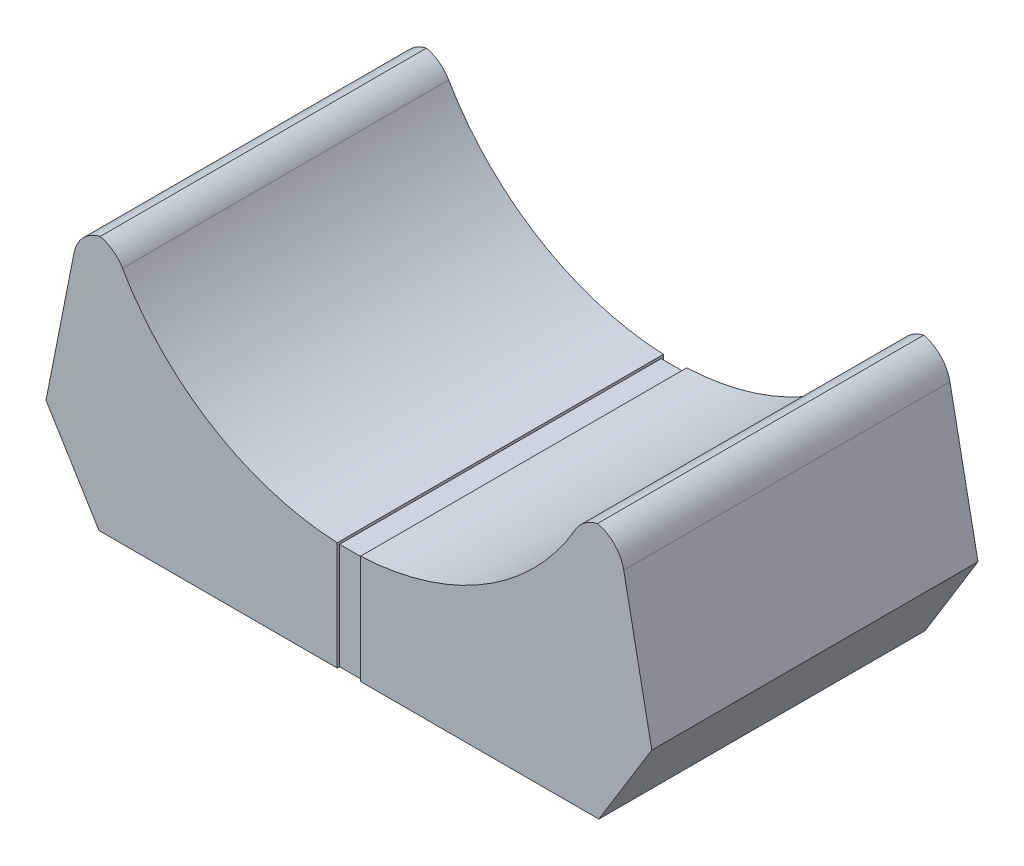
ISO-10303-21;
HEADER;
FILE_DESCRIPTION(('STEP AP214'),'2;1');
FILE_NAME('part.step','',(''),(''),'','','');
FILE_SCHEMA(('AUTOMOTIVE_DESIGN { 1 0 10303 214 1 1 1 1 }'));
ENDSEC;
DATA;
#1=APPLICATION_CONTEXT('core data for automotive mechanical design processes');
#2=APPLICATION_PROTOCOL_DEFINITION('international standard','automotive_design',2000,#1);
#3=PRODUCT_CONTEXT('',#1,'mechanical');
#4=PRODUCT('Part','Part','',(#3));
#5=PRODUCT_RELATED_PRODUCT_CATEGORY('part','',(#4));
#6=PRODUCT_DEFINITION_FORMATION('','',#4);
#7=PRODUCT_DEFINITION_CONTEXT('part definition',#1,'design');
#8=PRODUCT_DEFINITION('design','',#6,#7);
#9=PRODUCT_DEFINITION_SHAPE('','',#8);
#10=(LENGTH_UNIT() NAMED_UNIT(*) SI_UNIT(.MILLI.,.METRE.));
#11=(NAMED_UNIT(*) PLANE_ANGLE_UNIT() SI_UNIT($,.RADIAN.));
#12=(NAMED_UNIT(*) SI_UNIT($,.STERADIAN.) SOLID_ANGLE_UNIT());
#13=UNCERTAINTY_MEASURE_WITH_UNIT(LENGTH_MEASURE(1.E-05),#10,'distance_accuracy_value','');
#14=(GEOMETRIC_REPRESENTATION_CONTEXT(3) GLOBAL_UNCERTAINTY_ASSIGNED_CONTEXT((#13)) GLOBAL_UNIT_ASSIGNED_CONTEXT((#10,
#11,#12)) REPRESENTATION_CONTEXT('',''));
#15=CARTESIAN_POINT('',(0.,0.,0.));
#16=DIRECTION('',(0.,0.,1.));
#17=DIRECTION('',(1.,0.,0.));
#18=AXIS2_PLACEMENT_3D('',#15,#16,#17);
#19=CARTESIAN_POINT('',(0.,15.8773975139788,-8.));
#20=DIRECTION('',(0.,0.,1.));
#21=DIRECTION('',(1.,0.,0.));
#22=AXIS2_PLACEMENT_3D('',#19,#20,#21);
#23=CYLINDRICAL_SURFACE('',#22,11.2283279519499);
#24=CARTESIAN_POINT('',(0.,15.8773975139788,-8.));
#25=DIRECTION('',(0.,0.,1.));
#26=DIRECTION('',(1.,0.,0.));
#27=AXIS2_PLACEMENT_3D('',#24,#25,#26);
#28=CIRCLE('',#27,11.2283279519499);
#29=CARTESIAN_POINT('',(0.499999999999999,4.66020764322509,-8.));
#30=VERTEX_POINT('',#29);
#31=CARTESIAN_POINT('',(9.71726791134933,10.251559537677,-8.));
#32=VERTEX_POINT('',#31);
#33=EDGE_CURVE('E271',#30,#32,#28,.T.);
#34=ORIENTED_EDGE('',*,*,#33,.F.);
#35=DIRECTION('',(0.,0.,1.));
#36=VECTOR('',#35,1.);
#37=CARTESIAN_POINT('',(0.5,4.66020764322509,-8.));
#38=LINE('',#37,#36);
#39=CARTESIAN_POINT('',(0.5,4.66020764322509,6.));
#40=VERTEX_POINT('',#39);
#41=EDGE_CURVE('E44',#30,#40,#38,.T.);
#42=ORIENTED_EDGE('',*,*,#41,.T.);
#43=CARTESIAN_POINT('',(0.,15.8773975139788,6.));
#44=DIRECTION('',(0.,0.,-1.));
#45=DIRECTION('',(-1.,0.,0.));
#46=AXIS2_PLACEMENT_3D('',#43,#44,#45);
#47=CIRCLE('',#46,11.2283279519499);
#48=CARTESIAN_POINT('',(9.71726791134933,10.251559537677,6.));
#49=VERTEX_POINT('',#48);
#50=EDGE_CURVE('E304',#49,#40,#47,.T.);
#51=ORIENTED_EDGE('',*,*,#50,.F.);
#52=DIRECTION('',(0.,0.,1.));
#53=VECTOR('',#52,1.);
#54=CARTESIAN_POINT('',(9.71726791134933,10.251559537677,-8.));
#55=LINE('',#54,#53);
#56=EDGE_CURVE('E352',#49,#32,#55,.F.);
#57=ORIENTED_EDGE('',*,*,#56,.T.);
#58=EDGE_LOOP('',(#34,#42,#51,#57));
#59=FACE_BOUND('',#58,.T.);
#60=ADVANCED_FACE('F36',(#59),#23,.F.);
#61=CARTESIAN_POINT('',(0.,0.,-8.));
#62=DIRECTION('',(0.,0.,-1.));
#63=DIRECTION('',(-1.,0.,0.));
#64=AXIS2_PLACEMENT_3D('',#61,#62,#63);
#65=PLANE('',#64);
#66=DIRECTION('',(0.,1.,0.));
#67=VECTOR('',#66,1.);
#68=CARTESIAN_POINT('',(-0.500000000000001,-1.6494248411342,-8.));
#69=LINE('',#68,#67);
#70=CARTESIAN_POINT('',(-0.500000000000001,0.,-8.));
#71=VERTEX_POINT('',#70);
#72=CARTESIAN_POINT('',(-0.500000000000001,4.66020764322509,-8.));
#73=VERTEX_POINT('',#72);
#74=EDGE_CURVE('E210',#71,#73,#69,.T.);
#75=ORIENTED_EDGE('',*,*,#74,.F.);
#76=DIRECTION('',(1.,0.,0.));
#77=VECTOR('',#76,1.);
#78=CARTESIAN_POINT('',(-13.,0.,-8.));
#79=LINE('',#78,#77);
#80=CARTESIAN_POINT('',(-10.7264228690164,0.,-8.));
#81=VERTEX_POINT('',#80);
#82=EDGE_CURVE('E300',#81,#71,#79,.T.);
#83=ORIENTED_EDGE('',*,*,#82,.F.);
#84=DIRECTION('',(-0.523296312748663,0.852150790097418,0.));
#85=VECTOR('',#84,1.);
#86=CARTESIAN_POINT('',(-13.,3.70235849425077,-8.));
#87=LINE('',#86,#85);
#88=CARTESIAN_POINT('',(-13.,3.70235849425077,-8.));
#89=VERTEX_POINT('',#88);
#90=EDGE_CURVE('E235',#81,#89,#87,.T.);
#91=ORIENTED_EDGE('',*,*,#90,.T.);
#92=DIRECTION('',(0.194000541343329,0.981001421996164,0.));
#93=VECTOR('',#92,1.);
#94=CARTESIAN_POINT('',(-11.5568355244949,11.,-8.));
#95=LINE('',#94,#93);
#96=CARTESIAN_POINT('',(-11.7959243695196,9.79100081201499,-8.));
#97=VERTEX_POINT('',#96);
#98=EDGE_CURVE('E239',#89,#97,#95,.T.);
#99=ORIENTED_EDGE('',*,*,#98,.T.);
#100=CARTESIAN_POINT('',(-10.3244222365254,9.5,-8.));
#101=DIRECTION('',(0.,0.,-1.));
#102=DIRECTION('',(-1.,0.,0.));
#103=AXIS2_PLACEMENT_3D('',#100,#101,#102);
#104=CIRCLE('',#103,1.5);
#105=CARTESIAN_POINT('',(-10.6699133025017,10.9596697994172,-8.));
#106=VERTEX_POINT('',#105);
#107=EDGE_CURVE('E343',#97,#106,#104,.T.);
#108=ORIENTED_EDGE('',*,*,#107,.T.);
#109=CARTESIAN_POINT('',(-11.0154043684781,9.5,-8.));
#110=DIRECTION('',(0.,0.,-1.));
#111=DIRECTION('',(-1.,0.,0.));
#112=AXIS2_PLACEMENT_3D('',#109,#110,#111);
#113=CIRCLE('',#112,1.5);
#114=CARTESIAN_POINT('',(-9.71726791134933,10.251559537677,-8.));
#115=VERTEX_POINT('',#114);
#116=EDGE_CURVE('E341',#106,#115,#113,.T.);
#117=ORIENTED_EDGE('',*,*,#116,.T.);
#118=EDGE_CURVE('E267',#115,#73,#28,.T.);
#119=ORIENTED_EDGE('',*,*,#118,.T.);
#120=EDGE_LOOP('',(#75,#83,#91,#99,#108,#117,#119));
#121=FACE_BOUND('',#120,.T.);
#122=ADVANCED_FACE('F420',(#121),#65,.T.);
#123=CARTESIAN_POINT('',(0.,0.,6.));
#124=DIRECTION('',(0.,0.,-1.));
#125=DIRECTION('',(-1.,0.,0.));
#126=AXIS2_PLACEMENT_3D('',#123,#124,#125);
#127=PLANE('',#126);
#128=ORIENTED_EDGE('',*,*,#50,.T.);
#129=DIRECTION('',(0.,1.,0.));
#130=VECTOR('',#129,1.);
#131=CARTESIAN_POINT('',(0.5,-1.55576541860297,6.));
#132=LINE('',#131,#130);
#133=CARTESIAN_POINT('',(0.5,0.,6.));
#134=VERTEX_POINT('',#133);
#135=EDGE_CURVE('E223',#134,#40,#132,.T.);
#136=ORIENTED_EDGE('',*,*,#135,.F.);
#137=DIRECTION('',(1.,0.,0.));
#138=VECTOR('',#137,1.);
#139=CARTESIAN_POINT('',(-13.,0.,6.));
#140=LINE('',#139,#138);
#141=CARTESIAN_POINT('',(10.7264228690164,0.,6.));
#142=VERTEX_POINT('',#141);
#143=EDGE_CURVE('E287',#134,#142,#140,.T.);
#144=ORIENTED_EDGE('',*,*,#143,.T.);
#145=DIRECTION('',(0.523296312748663,0.852150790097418,0.));
#146=VECTOR('',#145,1.);
#147=CARTESIAN_POINT('',(13.,3.70235849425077,6.));
#148=LINE('',#147,#146);
#149=CARTESIAN_POINT('',(13.,3.70235849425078,6.));
#150=VERTEX_POINT('',#149);
#151=EDGE_CURVE('E250',#142,#150,#148,.T.);
#152=ORIENTED_EDGE('',*,*,#151,.T.);
#153=DIRECTION('',(-0.194000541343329,0.981001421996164,0.));
#154=VECTOR('',#153,1.);
#155=CARTESIAN_POINT('',(11.5568355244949,11.,6.));
#156=LINE('',#155,#154);
#157=CARTESIAN_POINT('',(11.7959243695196,9.79100081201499,6.));
#158=VERTEX_POINT('',#157);
#159=EDGE_CURVE('E253',#150,#158,#156,.T.);
#160=ORIENTED_EDGE('',*,*,#159,.T.);
#161=CARTESIAN_POINT('',(10.3244222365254,9.5,6.));
#162=DIRECTION('',(0.,0.,-1.));
#163=DIRECTION('',(-1.,0.,0.));
#164=AXIS2_PLACEMENT_3D('',#161,#162,#163);
#165=CIRCLE('',#164,1.5);
#166=CARTESIAN_POINT('',(10.6699133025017,10.9596697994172,6.));
#167=VERTEX_POINT('',#166);
#168=EDGE_CURVE('E345',#158,#167,#165,.F.);
#169=ORIENTED_EDGE('',*,*,#168,.T.);
#170=CARTESIAN_POINT('',(11.0154043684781,9.5,6.));
#171=DIRECTION('',(0.,0.,-1.));
#172=DIRECTION('',(-1.,0.,0.));
#173=AXIS2_PLACEMENT_3D('',#170,#171,#172);
#174=CIRCLE('',#173,1.5);
#175=EDGE_CURVE('E347',#167,#49,#174,.F.);
#176=ORIENTED_EDGE('',*,*,#175,.T.);
#177=EDGE_LOOP('',(#128,#136,#144,#152,#160,#169,#176));
#178=FACE_BOUND('',#177,.T.);
#179=ADVANCED_FACE('F374',(#178),#127,.F.);
#180=CARTESIAN_POINT('',(-13.,0.,-8.));
#181=DIRECTION('',(0.,-1.,0.));
#182=DIRECTION('',(0.,0.,-1.));
#183=AXIS2_PLACEMENT_3D('',#180,#181,#182);
#184=PLANE('',#183);
#185=DIRECTION('',(0.,0.,-1.));
#186=VECTOR('',#185,1.);
#187=CARTESIAN_POINT('',(-0.5,0.,-8.));
#188=LINE('',#187,#186);
#189=CARTESIAN_POINT('',(-0.500000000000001,0.,-7.9));
#190=VERTEX_POINT('',#189);
#191=EDGE_CURVE('E225',#190,#71,#188,.T.);
#192=ORIENTED_EDGE('',*,*,#191,.F.);
#193=DIRECTION('',(-1.,0.,0.));
#194=VECTOR('',#193,1.);
#195=CARTESIAN_POINT('',(-13.,0.,-7.9));
#196=LINE('',#195,#194);
#197=CARTESIAN_POINT('',(0.499999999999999,0.,-7.9));
#198=VERTEX_POINT('',#197);
#199=EDGE_CURVE('E415',#198,#190,#196,.T.);
#200=ORIENTED_EDGE('',*,*,#199,.F.);
#201=DIRECTION('',(0.,0.,1.));
#202=VECTOR('',#201,1.);
#203=CARTESIAN_POINT('',(0.499999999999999,0.,-8.));
#204=LINE('',#203,#202);
#205=CARTESIAN_POINT('',(0.499999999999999,0.,-8.));
#206=VERTEX_POINT('',#205);
#207=EDGE_CURVE('E405',#206,#198,#204,.T.);
#208=ORIENTED_EDGE('',*,*,#207,.F.);
#209=CARTESIAN_POINT('',(10.7264228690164,0.,-8.));
#210=VERTEX_POINT('',#209);
#211=EDGE_CURVE('E299',#206,#210,#79,.T.);
#212=ORIENTED_EDGE('',*,*,#211,.T.);
#213=DIRECTION('',(0.,0.,-1.));
#214=VECTOR('',#213,1.);
#215=CARTESIAN_POINT('',(10.7264228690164,0.,6.));
#216=LINE('',#215,#214);
#217=EDGE_CURVE('E257',#142,#210,#216,.T.);
#218=ORIENTED_EDGE('',*,*,#217,.F.);
#219=ORIENTED_EDGE('',*,*,#143,.F.);
#220=DIRECTION('',(0.,0.,1.));
#221=VECTOR('',#220,1.);
#222=CARTESIAN_POINT('',(0.5,0.,-8.));
#223=LINE('',#222,#221);
#224=CARTESIAN_POINT('',(0.5,0.,5.9));
#225=VERTEX_POINT('',#224);
#226=EDGE_CURVE('E228',#225,#134,#223,.T.);
#227=ORIENTED_EDGE('',*,*,#226,.F.);
#228=DIRECTION('',(1.,0.,0.));
#229=VECTOR('',#228,1.);
#230=CARTESIAN_POINT('',(-13.,0.,5.9));
#231=LINE('',#230,#229);
#232=CARTESIAN_POINT('',(-0.5,0.,5.9));
#233=VERTEX_POINT('',#232);
#234=EDGE_CURVE('E216',#233,#225,#231,.T.);
#235=ORIENTED_EDGE('',*,*,#234,.F.);
#236=DIRECTION('',(0.,0.,-1.));
#237=VECTOR('',#236,1.);
#238=CARTESIAN_POINT('',(-0.5,0.,-8.));
#239=LINE('',#238,#237);
#240=CARTESIAN_POINT('',(-0.5,0.,6.));
#241=VERTEX_POINT('',#240);
#242=EDGE_CURVE('E214',#241,#233,#239,.T.);
#243=ORIENTED_EDGE('',*,*,#242,.F.);
#244=CARTESIAN_POINT('',(-10.7264228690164,0.,6.));
#245=VERTEX_POINT('',#244);
#246=EDGE_CURVE('E296',#245,#241,#140,.T.);
#247=ORIENTED_EDGE('',*,*,#246,.F.);
#248=DIRECTION('',(0.,0.,-1.));
#249=VECTOR('',#248,1.);
#250=CARTESIAN_POINT('',(-10.7264228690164,0.,6.));
#251=LINE('',#250,#249);
#252=EDGE_CURVE('E245',#245,#81,#251,.T.);
#253=ORIENTED_EDGE('',*,*,#252,.T.);
#254=ORIENTED_EDGE('',*,*,#82,.T.);
#255=EDGE_LOOP('',(#192,#200,#208,#212,#218,#219,#227,#235,#243,#247,#253,#254));
#256=FACE_BOUND('',#255,.T.);
#257=DIRECTION('',(1.,0.,0.));
#258=VECTOR('',#257,1.);
#259=CARTESIAN_POINT('',(9.18540690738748,0.,0.354189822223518));
#260=LINE('',#259,#258);
#261=CARTESIAN_POINT('',(-10.0645930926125,0.,0.354189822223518));
#262=VERTEX_POINT('',#261);
#263=CARTESIAN_POINT('',(9.93540690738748,0.,0.354189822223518));
#264=VERTEX_POINT('',#263);
#265=EDGE_CURVE('E312',#262,#264,#260,.T.);
#266=ORIENTED_EDGE('',*,*,#265,.T.);
#267=DIRECTION('',(0.,0.,-1.));
#268=VECTOR('',#267,1.);
#269=CARTESIAN_POINT('',(9.93540690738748,0.,-1.59581017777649));
#270=LINE('',#269,#268);
#271=CARTESIAN_POINT('',(9.93540690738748,0.,-2.34581017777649));
#272=VERTEX_POINT('',#271);
#273=EDGE_CURVE('E316',#264,#272,#270,.T.);
#274=ORIENTED_EDGE('',*,*,#273,.T.);
#275=DIRECTION('',(-1.,0.,0.));
#276=VECTOR('',#275,1.);
#277=CARTESIAN_POINT('',(-9.31459309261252,0.,-2.34581017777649));
#278=LINE('',#277,#276);
#279=CARTESIAN_POINT('',(-10.0645930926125,0.,-2.34581017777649));
#280=VERTEX_POINT('',#279);
#281=EDGE_CURVE('E314',#272,#280,#278,.T.);
#282=ORIENTED_EDGE('',*,*,#281,.T.);
#283=DIRECTION('',(0.,0.,1.));
#284=VECTOR('',#283,1.);
#285=CARTESIAN_POINT('',(-10.0645930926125,0.,-0.395810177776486));
#286=LINE('',#285,#284);
#287=EDGE_CURVE('E310',#280,#262,#286,.T.);
#288=ORIENTED_EDGE('',*,*,#287,.T.);
#289=EDGE_LOOP('',(#266,#274,#282,#288));
#290=FACE_BOUND('',#289,.T.);
#291=ADVANCED_FACE('F398',(#256,#290),#184,.T.);
#292=DIRECTION('',(0.,-1.,0.));
#293=VECTOR('',#292,1.);
#294=CARTESIAN_POINT('',(0.499999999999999,-1.6494248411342,-8.));
#295=LINE('',#294,#293);
#296=EDGE_CURVE('E406',#30,#206,#295,.T.);
#297=ORIENTED_EDGE('',*,*,#296,.F.);
#298=ORIENTED_EDGE('',*,*,#33,.T.);
#299=CARTESIAN_POINT('',(11.0154043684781,9.5,-8.));
#300=DIRECTION('',(0.,0.,-1.));
#301=DIRECTION('',(-1.,0.,0.));
#302=AXIS2_PLACEMENT_3D('',#299,#300,#301);
#303=CIRCLE('',#302,1.5);
#304=CARTESIAN_POINT('',(10.6699133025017,10.9596697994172,-8.));
#305=VERTEX_POINT('',#304);
#306=EDGE_CURVE('E339',#32,#305,#303,.T.);
#307=ORIENTED_EDGE('',*,*,#306,.T.);
#308=CARTESIAN_POINT('',(10.3244222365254,9.5,-8.));
#309=DIRECTION('',(0.,0.,-1.));
#310=DIRECTION('',(-1.,0.,0.));
#311=AXIS2_PLACEMENT_3D('',#308,#309,#310);
#312=CIRCLE('',#311,1.5);
#313=CARTESIAN_POINT('',(11.7959243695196,9.79100081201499,-8.));
#314=VERTEX_POINT('',#313);
#315=EDGE_CURVE('E337',#305,#314,#312,.T.);
#316=ORIENTED_EDGE('',*,*,#315,.T.);
#317=DIRECTION('',(-0.194000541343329,0.981001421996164,0.));
#318=VECTOR('',#317,1.);
#319=CARTESIAN_POINT('',(11.5568355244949,11.,-8.));
#320=LINE('',#319,#318);
#321=CARTESIAN_POINT('',(13.,3.70235849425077,-8.));
#322=VERTEX_POINT('',#321);
#323=EDGE_CURVE('E254',#322,#314,#320,.T.);
#324=ORIENTED_EDGE('',*,*,#323,.F.);
#325=DIRECTION('',(0.523296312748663,0.852150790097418,0.));
#326=VECTOR('',#325,1.);
#327=CARTESIAN_POINT('',(13.,3.70235849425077,-8.));
#328=LINE('',#327,#326);
#329=EDGE_CURVE('E248',#210,#322,#328,.T.);
#330=ORIENTED_EDGE('',*,*,#329,.F.);
#331=ORIENTED_EDGE('',*,*,#211,.F.);
#332=EDGE_LOOP('',(#297,#298,#307,#316,#324,#330,#331));
#333=FACE_BOUND('',#332,.T.);
#334=ADVANCED_FACE('F384',(#333),#65,.T.);
#335=ORIENTED_EDGE('',*,*,#246,.T.);
#336=DIRECTION('',(0.,-1.,0.));
#337=VECTOR('',#336,1.);
#338=CARTESIAN_POINT('',(-0.5,-1.55576541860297,6.));
#339=LINE('',#338,#337);
#340=CARTESIAN_POINT('',(-0.5,4.66020764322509,6.));
#341=VERTEX_POINT('',#340);
#342=EDGE_CURVE('E219',#341,#241,#339,.T.);
#343=ORIENTED_EDGE('',*,*,#342,.F.);
#344=CARTESIAN_POINT('',(-9.71726791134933,10.251559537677,6.));
#345=VERTEX_POINT('',#344);
#346=EDGE_CURVE('E303',#341,#345,#47,.T.);
#347=ORIENTED_EDGE('',*,*,#346,.T.);
#348=CARTESIAN_POINT('',(-11.0154043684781,9.5,6.));
#349=DIRECTION('',(0.,0.,-1.));
#350=DIRECTION('',(-1.,0.,0.));
#351=AXIS2_PLACEMENT_3D('',#348,#349,#350);
#352=CIRCLE('',#351,1.5);
#353=CARTESIAN_POINT('',(-10.6699133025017,10.9596697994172,6.));
#354=VERTEX_POINT('',#353);
#355=EDGE_CURVE('E59',#345,#354,#352,.F.);
#356=ORIENTED_EDGE('',*,*,#355,.T.);
#357=CARTESIAN_POINT('',(-10.3244222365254,9.5,6.));
#358=DIRECTION('',(0.,0.,-1.));
#359=DIRECTION('',(-1.,0.,0.));
#360=AXIS2_PLACEMENT_3D('',#357,#358,#359);
#361=CIRCLE('',#360,1.5);
#362=CARTESIAN_POINT('',(-11.7959243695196,9.79100081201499,6.));
#363=VERTEX_POINT('',#362);
#364=EDGE_CURVE('E350',#354,#363,#361,.F.);
#365=ORIENTED_EDGE('',*,*,#364,.T.);
#366=DIRECTION('',(0.194000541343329,0.981001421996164,0.));
#367=VECTOR('',#366,1.);
#368=CARTESIAN_POINT('',(-11.5568355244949,11.,6.));
#369=LINE('',#368,#367);
#370=CARTESIAN_POINT('',(-13.,3.70235849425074,6.));
#371=VERTEX_POINT('',#370);
#372=EDGE_CURVE('E231',#371,#363,#369,.T.);
#373=ORIENTED_EDGE('',*,*,#372,.F.);
#374=DIRECTION('',(-0.523296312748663,0.852150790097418,0.));
#375=VECTOR('',#374,1.);
#376=CARTESIAN_POINT('',(-13.,3.70235849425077,6.));
#377=LINE('',#376,#375);
#378=EDGE_CURVE('E234',#245,#371,#377,.T.);
#379=ORIENTED_EDGE('',*,*,#378,.F.);
#380=EDGE_LOOP('',(#335,#343,#347,#356,#365,#373,#379));
#381=FACE_BOUND('',#380,.T.);
#382=ADVANCED_FACE('F427',(#381),#127,.F.);
#383=CARTESIAN_POINT('',(9.18540690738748,3.,-1.59581017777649));
#384=DIRECTION('',(1.,0.,0.));
#385=DIRECTION('',(0.,1.,0.));
#386=AXIS2_PLACEMENT_3D('',#383,#384,#385);
#387=PLANE('',#386);
#388=DIRECTION('',(0.,-1.,0.));
#389=VECTOR('',#388,1.);
#390=CARTESIAN_POINT('',(9.18540690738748,3.,-1.59581017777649));
#391=LINE('',#390,#389);
#392=CARTESIAN_POINT('',(9.18540690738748,3.,-1.59581017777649));
#393=VERTEX_POINT('',#392);
#394=CARTESIAN_POINT('',(9.18540690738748,1.29903810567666,-1.59581017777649));
#395=VERTEX_POINT('',#394);
#396=EDGE_CURVE('E284',#393,#395,#391,.T.);
#397=ORIENTED_EDGE('',*,*,#396,.T.);
#398=DIRECTION('',(0.,0.,1.));
#399=VECTOR('',#398,1.);
#400=CARTESIAN_POINT('',(9.18540690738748,1.29903810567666,-0.395810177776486));
#401=LINE('',#400,#399);
#402=CARTESIAN_POINT('',(9.18540690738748,1.29903810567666,-0.395810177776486));
#403=VERTEX_POINT('',#402);
#404=EDGE_CURVE('E307',#395,#403,#401,.T.);
#405=ORIENTED_EDGE('',*,*,#404,.T.);
#406=DIRECTION('',(0.,-1.,0.));
#407=VECTOR('',#406,1.);
#408=CARTESIAN_POINT('',(9.18540690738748,3.,-0.395810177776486));
#409=LINE('',#408,#407);
#410=CARTESIAN_POINT('',(9.18540690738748,3.,-0.395810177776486));
#411=VERTEX_POINT('',#410);
#412=EDGE_CURVE('E283',#411,#403,#409,.T.);
#413=ORIENTED_EDGE('',*,*,#412,.F.);
#414=DIRECTION('',(0.,0.,1.));
#415=VECTOR('',#414,1.);
#416=CARTESIAN_POINT('',(9.18540690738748,3.,-1.59581017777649));
#417=LINE('',#416,#415);
#418=EDGE_CURVE('E270',#393,#411,#417,.T.);
#419=ORIENTED_EDGE('',*,*,#418,.F.);
#420=EDGE_LOOP('',(#397,#405,#413,#419));
#421=FACE_BOUND('',#420,.T.);
#422=ADVANCED_FACE('F486',(#421),#387,.F.);
#423=CARTESIAN_POINT('',(-9.31459309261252,3.,-1.59581017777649));
#424=DIRECTION('',(0.,0.,-1.));
#425=DIRECTION('',(-1.,0.,0.));
#426=AXIS2_PLACEMENT_3D('',#423,#424,#425);
#427=PLANE('',#426);
#428=DIRECTION('',(0.,-1.,0.));
#429=VECTOR('',#428,1.);
#430=CARTESIAN_POINT('',(-9.31459309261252,3.,-1.59581017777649));
#431=LINE('',#430,#429);
#432=CARTESIAN_POINT('',(-9.31459309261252,3.,-1.59581017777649));
#433=VERTEX_POINT('',#432);
#434=CARTESIAN_POINT('',(-9.31459309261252,1.29903810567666,-1.59581017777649));
#435=VERTEX_POINT('',#434);
#436=EDGE_CURVE('E288',#433,#435,#431,.T.);
#437=ORIENTED_EDGE('',*,*,#436,.T.);
#438=DIRECTION('',(1.,0.,0.));
#439=VECTOR('',#438,1.);
#440=CARTESIAN_POINT('',(9.18540690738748,1.29903810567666,-1.59581017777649));
#441=LINE('',#440,#439);
#442=EDGE_CURVE('E319',#435,#395,#441,.T.);
#443=ORIENTED_EDGE('',*,*,#442,.T.);
#444=ORIENTED_EDGE('',*,*,#396,.F.);
#445=DIRECTION('',(1.,0.,0.));
#446=VECTOR('',#445,1.);
#447=CARTESIAN_POINT('',(-9.31459309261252,3.,-1.59581017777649));
#448=LINE('',#447,#446);
#449=EDGE_CURVE('E280',#433,#393,#448,.T.);
#450=ORIENTED_EDGE('',*,*,#449,.F.);
#451=EDGE_LOOP('',(#437,#443,#444,#450));
#452=FACE_BOUND('',#451,.T.);
#453=ADVANCED_FACE('F483',(#452),#427,.F.);
#454=CARTESIAN_POINT('',(-9.31459309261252,3.,-1.59581017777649));
#455=DIRECTION('',(-1.,0.,0.));
#456=DIRECTION('',(0.,-1.,0.));
#457=AXIS2_PLACEMENT_3D('',#454,#455,#456);
#458=PLANE('',#457);
#459=DIRECTION('',(0.,-1.,0.));
#460=VECTOR('',#459,1.);
#461=CARTESIAN_POINT('',(-9.31459309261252,3.,-0.395810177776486));
#462=LINE('',#461,#460);
#463=CARTESIAN_POINT('',(-9.31459309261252,3.,-0.395810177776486));
#464=VERTEX_POINT('',#463);
#465=CARTESIAN_POINT('',(-9.31459309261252,1.29903810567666,-0.395810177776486));
#466=VERTEX_POINT('',#465);
#467=EDGE_CURVE('E291',#464,#466,#462,.T.);
#468=ORIENTED_EDGE('',*,*,#467,.T.);
#469=DIRECTION('',(0.,0.,-1.));
#470=VECTOR('',#469,1.);
#471=CARTESIAN_POINT('',(-9.31459309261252,1.29903810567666,-1.59581017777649));
#472=LINE('',#471,#470);
#473=EDGE_CURVE('E323',#466,#435,#472,.T.);
#474=ORIENTED_EDGE('',*,*,#473,.T.);
#475=ORIENTED_EDGE('',*,*,#436,.F.);
#476=DIRECTION('',(0.,0.,-1.));
#477=VECTOR('',#476,1.);
#478=CARTESIAN_POINT('',(-9.31459309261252,3.,-1.59581017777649));
#479=LINE('',#478,#477);
#480=EDGE_CURVE('E277',#464,#433,#479,.T.);
#481=ORIENTED_EDGE('',*,*,#480,.F.);
#482=EDGE_LOOP('',(#468,#474,#475,#481));
#483=FACE_BOUND('',#482,.T.);
#484=ADVANCED_FACE('F479',(#483),#458,.F.);
#485=CARTESIAN_POINT('',(-9.31459309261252,3.,-0.395810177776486));
#486=DIRECTION('',(0.,0.,1.));
#487=DIRECTION('',(1.,0.,0.));
#488=AXIS2_PLACEMENT_3D('',#485,#486,#487);
#489=PLANE('',#488);
#490=ORIENTED_EDGE('',*,*,#412,.T.);
#491=DIRECTION('',(-1.,0.,0.));
#492=VECTOR('',#491,1.);
#493=CARTESIAN_POINT('',(-9.31459309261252,1.29903810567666,-0.395810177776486));
#494=LINE('',#493,#492);
#495=EDGE_CURVE('E321',#403,#466,#494,.T.);
#496=ORIENTED_EDGE('',*,*,#495,.T.);
#497=ORIENTED_EDGE('',*,*,#467,.F.);
#498=DIRECTION('',(-1.,0.,0.));
#499=VECTOR('',#498,1.);
#500=CARTESIAN_POINT('',(-9.31459309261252,3.,-0.395810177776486));
#501=LINE('',#500,#499);
#502=EDGE_CURVE('E274',#411,#464,#501,.T.);
#503=ORIENTED_EDGE('',*,*,#502,.F.);
#504=EDGE_LOOP('',(#490,#496,#497,#503));
#505=FACE_BOUND('',#504,.T.);
#506=ADVANCED_FACE('F474',(#505),#489,.F.);
#507=CARTESIAN_POINT('',(0.,3.,0.));
#508=DIRECTION('',(0.,1.,0.));
#509=DIRECTION('',(-1.,0.,0.));
#510=AXIS2_PLACEMENT_3D('',#507,#508,#509);
#511=PLANE('',#510);
#512=ORIENTED_EDGE('',*,*,#418,.T.);
#513=ORIENTED_EDGE('',*,*,#502,.T.);
#514=ORIENTED_EDGE('',*,*,#480,.T.);
#515=ORIENTED_EDGE('',*,*,#449,.T.);
#516=EDGE_LOOP('',(#512,#513,#514,#515));
#517=FACE_BOUND('',#516,.T.);
#518=ADVANCED_FACE('F466',(#517),#511,.F.);
#519=DIRECTION('',(0.,0.,1.));
#520=VECTOR('',#519,1.);
#521=CARTESIAN_POINT('',(-0.5,4.66020764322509,-8.));
#522=LINE('',#521,#520);
#523=EDGE_CURVE('E360',#341,#73,#522,.F.);
#524=ORIENTED_EDGE('',*,*,#523,.T.);
#525=ORIENTED_EDGE('',*,*,#118,.F.);
#526=DIRECTION('',(0.,0.,1.));
#527=VECTOR('',#526,1.);
#528=CARTESIAN_POINT('',(-9.71726791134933,10.251559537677,-8.));
#529=LINE('',#528,#527);
#530=EDGE_CURVE('E355',#115,#345,#529,.T.);
#531=ORIENTED_EDGE('',*,*,#530,.T.);
#532=ORIENTED_EDGE('',*,*,#346,.F.);
#533=EDGE_LOOP('',(#524,#525,#531,#532));
#534=FACE_BOUND('',#533,.T.);
#535=ADVANCED_FACE('F442',(#534),#23,.F.);
#536=CARTESIAN_POINT('',(-9.31459309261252,1.29903810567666,-1.59581017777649));
#537=DIRECTION('',(0.866025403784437,-0.500000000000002,0.));
#538=DIRECTION('',(0.,0.,1.));
#539=AXIS2_PLACEMENT_3D('',#536,#537,#538);
#540=PLANE('',#539);
#541=DIRECTION('',(-0.44721359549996,-0.774596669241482,0.447213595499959));
#542=VECTOR('',#541,1.);
#543=CARTESIAN_POINT('',(-9.31459309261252,1.29903810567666,-0.395810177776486));
#544=LINE('',#543,#542);
#545=EDGE_CURVE('E329',#262,#466,#544,.F.);
#546=ORIENTED_EDGE('',*,*,#545,.F.);
#547=ORIENTED_EDGE('',*,*,#287,.F.);
#548=DIRECTION('',(0.44721359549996,0.774596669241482,0.447213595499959));
#549=VECTOR('',#548,1.);
#550=CARTESIAN_POINT('',(-9.31459309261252,1.29903810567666,-1.59581017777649));
#551=LINE('',#550,#549);
#552=EDGE_CURVE('E332',#435,#280,#551,.F.);
#553=ORIENTED_EDGE('',*,*,#552,.F.);
#554=ORIENTED_EDGE('',*,*,#473,.F.);
#555=EDGE_LOOP('',(#546,#547,#553,#554));
#556=FACE_BOUND('',#555,.T.);
#557=ADVANCED_FACE('F465',(#556),#540,.T.);
#558=CARTESIAN_POINT('',(-9.31459309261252,1.29903810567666,-1.59581017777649));
#559=DIRECTION('',(0.,-0.500000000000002,0.866025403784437));
#560=DIRECTION('',(-1.,0.,0.));
#561=AXIS2_PLACEMENT_3D('',#558,#559,#560);
#562=PLANE('',#561);
#563=ORIENTED_EDGE('',*,*,#552,.T.);
#564=ORIENTED_EDGE('',*,*,#281,.F.);
#565=DIRECTION('',(-0.44721359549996,0.774596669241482,0.447213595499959));
#566=VECTOR('',#565,1.);
#567=CARTESIAN_POINT('',(9.18540690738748,1.29903810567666,-1.59581017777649));
#568=LINE('',#567,#566);
#569=EDGE_CURVE('E327',#395,#272,#568,.F.);
#570=ORIENTED_EDGE('',*,*,#569,.F.);
#571=ORIENTED_EDGE('',*,*,#442,.F.);
#572=EDGE_LOOP('',(#563,#564,#570,#571));
#573=FACE_BOUND('',#572,.T.);
#574=ADVANCED_FACE('F471',(#573),#562,.T.);
#575=CARTESIAN_POINT('',(-9.31459309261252,1.29903810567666,-0.395810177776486));
#576=DIRECTION('',(0.,-0.500000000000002,-0.866025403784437));
#577=DIRECTION('',(1.,0.,0.));
#578=AXIS2_PLACEMENT_3D('',#575,#576,#577);
#579=PLANE('',#578);
#580=ORIENTED_EDGE('',*,*,#545,.T.);
#581=ORIENTED_EDGE('',*,*,#495,.F.);
#582=DIRECTION('',(0.44721359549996,-0.774596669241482,0.447213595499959));
#583=VECTOR('',#582,1.);
#584=CARTESIAN_POINT('',(8.94540690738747,1.71473029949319,-0.635810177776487));
#585=LINE('',#584,#583);
#586=EDGE_CURVE('E264',#264,#403,#585,.F.);
#587=ORIENTED_EDGE('',*,*,#586,.F.);
#588=ORIENTED_EDGE('',*,*,#265,.F.);
#589=EDGE_LOOP('',(#580,#581,#587,#588));
#590=FACE_BOUND('',#589,.T.);
#591=ADVANCED_FACE('F502',(#590),#579,.T.);
#592=CARTESIAN_POINT('',(9.18540690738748,1.29903810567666,-1.59581017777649));
#593=DIRECTION('',(-0.866025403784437,-0.500000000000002,0.));
#594=DIRECTION('',(0.,0.,-1.));
#595=AXIS2_PLACEMENT_3D('',#592,#593,#594);
#596=PLANE('',#595);
#597=ORIENTED_EDGE('',*,*,#569,.T.);
#598=ORIENTED_EDGE('',*,*,#273,.F.);
#599=ORIENTED_EDGE('',*,*,#586,.T.);
#600=ORIENTED_EDGE('',*,*,#404,.F.);
#601=EDGE_LOOP('',(#597,#598,#599,#600));
#602=FACE_BOUND('',#601,.T.);
#603=ADVANCED_FACE('F499',(#602),#596,.T.);
#604=CARTESIAN_POINT('',(11.5568355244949,11.,6.));
#605=DIRECTION('',(-0.981001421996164,-0.194000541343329,0.));
#606=DIRECTION('',(0.194000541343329,-0.981001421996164,0.));
#607=AXIS2_PLACEMENT_3D('',#604,#605,#606);
#608=PLANE('',#607);
#609=ORIENTED_EDGE('',*,*,#323,.T.);
#610=DIRECTION('',(0.,0.,-1.));
#611=VECTOR('',#610,1.);
#612=CARTESIAN_POINT('',(11.7959243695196,9.79100081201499,6.));
#613=LINE('',#612,#611);
#614=EDGE_CURVE('E358',#314,#158,#613,.F.);
#615=ORIENTED_EDGE('',*,*,#614,.T.);
#616=ORIENTED_EDGE('',*,*,#159,.F.);
#617=DIRECTION('',(0.,0.,-1.));
#618=VECTOR('',#617,1.);
#619=CARTESIAN_POINT('',(13.,3.70235849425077,6.));
#620=LINE('',#619,#618);
#621=EDGE_CURVE('E262',#150,#322,#620,.T.);
#622=ORIENTED_EDGE('',*,*,#621,.T.);
#623=EDGE_LOOP('',(#609,#615,#616,#622));
#624=FACE_BOUND('',#623,.T.);
#625=ADVANCED_FACE('F389',(#624),#608,.F.);
#626=CARTESIAN_POINT('',(13.,3.70235849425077,6.));
#627=DIRECTION('',(-0.852150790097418,0.523296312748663,0.));
#628=DIRECTION('',(-0.523296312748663,-0.852150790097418,0.));
#629=AXIS2_PLACEMENT_3D('',#626,#627,#628);
#630=PLANE('',#629);
#631=ORIENTED_EDGE('',*,*,#329,.T.);
#632=ORIENTED_EDGE('',*,*,#621,.F.);
#633=ORIENTED_EDGE('',*,*,#151,.F.);
#634=ORIENTED_EDGE('',*,*,#217,.T.);
#635=EDGE_LOOP('',(#631,#632,#633,#634));
#636=FACE_BOUND('',#635,.T.);
#637=ADVANCED_FACE('F394',(#636),#630,.F.);
#638=CARTESIAN_POINT('',(-13.,3.70235849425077,6.));
#639=DIRECTION('',(-0.852150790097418,-0.523296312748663,0.));
#640=DIRECTION('',(0.523296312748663,-0.852150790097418,0.));
#641=AXIS2_PLACEMENT_3D('',#638,#639,#640);
#642=PLANE('',#641);
#643=ORIENTED_EDGE('',*,*,#90,.F.);
#644=ORIENTED_EDGE('',*,*,#252,.F.);
#645=ORIENTED_EDGE('',*,*,#378,.T.);
#646=DIRECTION('',(0.,0.,-1.));
#647=VECTOR('',#646,1.);
#648=CARTESIAN_POINT('',(-13.,3.70235849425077,6.));
#649=LINE('',#648,#647);
#650=EDGE_CURVE('E238',#371,#89,#649,.T.);
#651=ORIENTED_EDGE('',*,*,#650,.T.);
#652=EDGE_LOOP('',(#643,#644,#645,#651));
#653=FACE_BOUND('',#652,.T.);
#654=ADVANCED_FACE('F425',(#653),#642,.T.);
#655=CARTESIAN_POINT('',(-11.5568355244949,11.,6.));
#656=DIRECTION('',(-0.981001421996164,0.194000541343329,0.));
#657=DIRECTION('',(-0.194000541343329,-0.981001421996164,0.));
#658=AXIS2_PLACEMENT_3D('',#655,#656,#657);
#659=PLANE('',#658);
#660=ORIENTED_EDGE('',*,*,#372,.T.);
#661=DIRECTION('',(0.,0.,-1.));
#662=VECTOR('',#661,1.);
#663=CARTESIAN_POINT('',(-11.7959243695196,9.79100081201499,6.));
#664=LINE('',#663,#662);
#665=EDGE_CURVE('E325',#363,#97,#664,.T.);
#666=ORIENTED_EDGE('',*,*,#665,.T.);
#667=ORIENTED_EDGE('',*,*,#98,.F.);
#668=ORIENTED_EDGE('',*,*,#650,.F.);
#669=EDGE_LOOP('',(#660,#666,#667,#668));
#670=FACE_BOUND('',#669,.T.);
#671=ADVANCED_FACE('F432',(#670),#659,.T.);
#672=CARTESIAN_POINT('',(-11.0154043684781,9.5,-8.));
#673=DIRECTION('',(0.,0.,1.));
#674=DIRECTION('',(1.,0.,0.));
#675=AXIS2_PLACEMENT_3D('',#672,#673,#674);
#676=CYLINDRICAL_SURFACE('',#675,1.5);
#677=DIRECTION('',(0.,0.,1.));
#678=VECTOR('',#677,1.);
#679=CARTESIAN_POINT('',(-10.6699133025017,10.9596697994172,-1.));
#680=LINE('',#679,#678);
#681=EDGE_CURVE('E242',#354,#106,#680,.F.);
#682=ORIENTED_EDGE('',*,*,#681,.F.);
#683=ORIENTED_EDGE('',*,*,#355,.F.);
#684=ORIENTED_EDGE('',*,*,#530,.F.);
#685=ORIENTED_EDGE('',*,*,#116,.F.);
#686=EDGE_LOOP('',(#682,#683,#684,#685));
#687=FACE_BOUND('',#686,.T.);
#688=ADVANCED_FACE('F439',(#687),#676,.T.);
#689=CARTESIAN_POINT('',(-10.3244222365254,9.5,6.));
#690=DIRECTION('',(0.,0.,-1.));
#691=DIRECTION('',(-1.,0.,0.));
#692=AXIS2_PLACEMENT_3D('',#689,#690,#691);
#693=CYLINDRICAL_SURFACE('',#692,1.5);
#694=ORIENTED_EDGE('',*,*,#364,.F.);
#695=ORIENTED_EDGE('',*,*,#681,.T.);
#696=ORIENTED_EDGE('',*,*,#107,.F.);
#697=ORIENTED_EDGE('',*,*,#665,.F.);
#698=EDGE_LOOP('',(#694,#695,#696,#697));
#699=FACE_BOUND('',#698,.T.);
#700=ADVANCED_FACE('F435',(#699),#693,.T.);
#701=CARTESIAN_POINT('',(10.3244222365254,9.5,-8.));
#702=DIRECTION('',(0.,0.,1.));
#703=DIRECTION('',(1.,0.,0.));
#704=AXIS2_PLACEMENT_3D('',#701,#702,#703);
#705=CYLINDRICAL_SURFACE('',#704,1.5);
#706=DIRECTION('',(0.,0.,1.));
#707=VECTOR('',#706,1.);
#708=CARTESIAN_POINT('',(10.6699133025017,10.9596697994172,-1.));
#709=LINE('',#708,#707);
#710=EDGE_CURVE('E230',#167,#305,#709,.F.);
#711=ORIENTED_EDGE('',*,*,#710,.F.);
#712=ORIENTED_EDGE('',*,*,#168,.F.);
#713=ORIENTED_EDGE('',*,*,#614,.F.);
#714=ORIENTED_EDGE('',*,*,#315,.F.);
#715=EDGE_LOOP('',(#711,#712,#713,#714));
#716=FACE_BOUND('',#715,.T.);
#717=ADVANCED_FACE('F38',(#716),#705,.T.);
#718=CARTESIAN_POINT('',(11.0154043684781,9.5,-8.));
#719=DIRECTION('',(0.,0.,1.));
#720=DIRECTION('',(1.,0.,0.));
#721=AXIS2_PLACEMENT_3D('',#718,#719,#720);
#722=CYLINDRICAL_SURFACE('',#721,1.5);
#723=ORIENTED_EDGE('',*,*,#175,.F.);
#724=ORIENTED_EDGE('',*,*,#710,.T.);
#725=ORIENTED_EDGE('',*,*,#306,.F.);
#726=ORIENTED_EDGE('',*,*,#56,.F.);
#727=EDGE_LOOP('',(#723,#724,#725,#726));
#728=FACE_BOUND('',#727,.T.);
#729=ADVANCED_FACE('F380',(#728),#722,.T.);
#730=CARTESIAN_POINT('',(0.5,-1.55576541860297,5.9));
#731=DIRECTION('',(1.,0.,0.));
#732=DIRECTION('',(0.,0.,-1.));
#733=AXIS2_PLACEMENT_3D('',#730,#731,#732);
#734=PLANE('',#733);
#735=ORIENTED_EDGE('',*,*,#135,.T.);
#736=ORIENTED_EDGE('',*,*,#41,.F.);
#737=ORIENTED_EDGE('',*,*,#296,.T.);
#738=ORIENTED_EDGE('',*,*,#207,.T.);
#739=DIRECTION('',(0.,-1.,0.));
#740=VECTOR('',#739,1.);
#741=CARTESIAN_POINT('',(0.499999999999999,-1.6494248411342,-7.9));
#742=LINE('',#741,#740);
#743=CARTESIAN_POINT('',(0.5,4.55209489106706,-7.9));
#744=VERTEX_POINT('',#743);
#745=EDGE_CURVE('E409',#744,#198,#742,.T.);
#746=ORIENTED_EDGE('',*,*,#745,.F.);
#747=DIRECTION('',(0.,0.,1.));
#748=VECTOR('',#747,1.);
#749=CARTESIAN_POINT('',(0.5,4.55209489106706,-8.));
#750=LINE('',#749,#748);
#751=CARTESIAN_POINT('',(0.5,4.55209489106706,5.9));
#752=VERTEX_POINT('',#751);
#753=EDGE_CURVE('E201',#744,#752,#750,.T.);
#754=ORIENTED_EDGE('',*,*,#753,.T.);
#755=DIRECTION('',(0.,1.,0.));
#756=VECTOR('',#755,1.);
#757=CARTESIAN_POINT('',(0.5,-1.55576541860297,5.9));
#758=LINE('',#757,#756);
#759=EDGE_CURVE('E209',#225,#752,#758,.T.);
#760=ORIENTED_EDGE('',*,*,#759,.F.);
#761=ORIENTED_EDGE('',*,*,#226,.T.);
#762=EDGE_LOOP('',(#735,#736,#737,#738,#746,#754,#760,#761));
#763=FACE_BOUND('',#762,.T.);
#764=ADVANCED_FACE('F443',(#763),#734,.F.);
#765=CARTESIAN_POINT('',(-0.5,-1.55576541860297,5.9));
#766=DIRECTION('',(-1.,0.,0.));
#767=DIRECTION('',(0.,0.,1.));
#768=AXIS2_PLACEMENT_3D('',#765,#766,#767);
#769=PLANE('',#768);
#770=DIRECTION('',(0.,-1.,0.));
#771=VECTOR('',#770,1.);
#772=CARTESIAN_POINT('',(-0.5,-1.55576541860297,5.9));
#773=LINE('',#772,#771);
#774=CARTESIAN_POINT('',(-0.5,4.55209489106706,5.9));
#775=VERTEX_POINT('',#774);
#776=EDGE_CURVE('E206',#775,#233,#773,.T.);
#777=ORIENTED_EDGE('',*,*,#776,.F.);
#778=DIRECTION('',(0.,0.,1.));
#779=VECTOR('',#778,1.);
#780=CARTESIAN_POINT('',(-0.5,4.55209489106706,-8.));
#781=LINE('',#780,#779);
#782=CARTESIAN_POINT('',(-0.500000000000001,4.55209489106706,-7.9));
#783=VERTEX_POINT('',#782);
#784=EDGE_CURVE('E51',#783,#775,#781,.T.);
#785=ORIENTED_EDGE('',*,*,#784,.F.);
#786=DIRECTION('',(0.,1.,0.));
#787=VECTOR('',#786,1.);
#788=CARTESIAN_POINT('',(-0.500000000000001,-1.6494248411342,-7.9));
#789=LINE('',#788,#787);
#790=EDGE_CURVE('E407',#190,#783,#789,.T.);
#791=ORIENTED_EDGE('',*,*,#790,.F.);
#792=ORIENTED_EDGE('',*,*,#191,.T.);
#793=ORIENTED_EDGE('',*,*,#74,.T.);
#794=ORIENTED_EDGE('',*,*,#523,.F.);
#795=ORIENTED_EDGE('',*,*,#342,.T.);
#796=ORIENTED_EDGE('',*,*,#242,.T.);
#797=EDGE_LOOP('',(#777,#785,#791,#792,#793,#794,#795,#796));
#798=FACE_BOUND('',#797,.T.);
#799=ADVANCED_FACE('F212',(#798),#769,.F.);
#800=CARTESIAN_POINT('',(0.,0.,5.9));
#801=DIRECTION('',(0.,0.,-1.));
#802=DIRECTION('',(-1.,0.,0.));
#803=AXIS2_PLACEMENT_3D('',#800,#801,#802);
#804=PLANE('',#803);
#805=ORIENTED_EDGE('',*,*,#759,.T.);
#806=DIRECTION('',(-1.,0.,0.));
#807=VECTOR('',#806,1.);
#808=CARTESIAN_POINT('',(0.,4.55209489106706,5.9));
#809=LINE('',#808,#807);
#810=EDGE_CURVE('E198',#752,#775,#809,.T.);
#811=ORIENTED_EDGE('',*,*,#810,.T.);
#812=ORIENTED_EDGE('',*,*,#776,.T.);
#813=ORIENTED_EDGE('',*,*,#234,.T.);
#814=EDGE_LOOP('',(#805,#811,#812,#813));
#815=FACE_BOUND('',#814,.T.);
#816=ADVANCED_FACE('F205',(#815),#804,.F.);
#817=CARTESIAN_POINT('',(0.,0.,-7.9));
#818=DIRECTION('',(0.,0.,1.));
#819=DIRECTION('',(1.,0.,0.));
#820=AXIS2_PLACEMENT_3D('',#817,#818,#819);
#821=PLANE('',#820);
#822=ORIENTED_EDGE('',*,*,#790,.T.);
#823=DIRECTION('',(1.,0.,0.));
#824=VECTOR('',#823,1.);
#825=CARTESIAN_POINT('',(0.,4.55209489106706,-7.9));
#826=LINE('',#825,#824);
#827=EDGE_CURVE('E11',#783,#744,#826,.T.);
#828=ORIENTED_EDGE('',*,*,#827,.T.);
#829=ORIENTED_EDGE('',*,*,#745,.T.);
#830=ORIENTED_EDGE('',*,*,#199,.T.);
#831=EDGE_LOOP('',(#822,#828,#829,#830));
#832=FACE_BOUND('',#831,.T.);
#833=ADVANCED_FACE('F447',(#832),#821,.F.);
#834=CARTESIAN_POINT('',(-0.5,4.55209489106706,-8.));
#835=DIRECTION('',(0.,-1.,0.));
#836=DIRECTION('',(0.,0.,-1.));
#837=AXIS2_PLACEMENT_3D('',#834,#835,#836);
#838=PLANE('',#837);
#839=ORIENTED_EDGE('',*,*,#753,.F.);
#840=ORIENTED_EDGE('',*,*,#827,.F.);
#841=ORIENTED_EDGE('',*,*,#784,.T.);
#842=ORIENTED_EDGE('',*,*,#810,.F.);
#843=EDGE_LOOP('',(#839,#840,#841,#842));
#844=FACE_BOUND('',#843,.T.);
#845=ADVANCED_FACE('F197',(#844),#838,.F.);
#846=CLOSED_SHELL('',(#60,#122,#179,#291,#334,#382,#422,#453,#484,#506,#518,#535,#557,#574,#591,
#603,#625,#637,#654,#671,#688,#700,#717,#729,#764,#799,#816,#833,#845));
#847=MANIFOLD_SOLID_BREP('B2',#846);
#848=ADVANCED_BREP_SHAPE_REPRESENTATION('',(#18,#847),#14);
#849=SHAPE_DEFINITION_REPRESENTATION(#9,#848);
ENDSEC;
END-ISO-10303-21;
